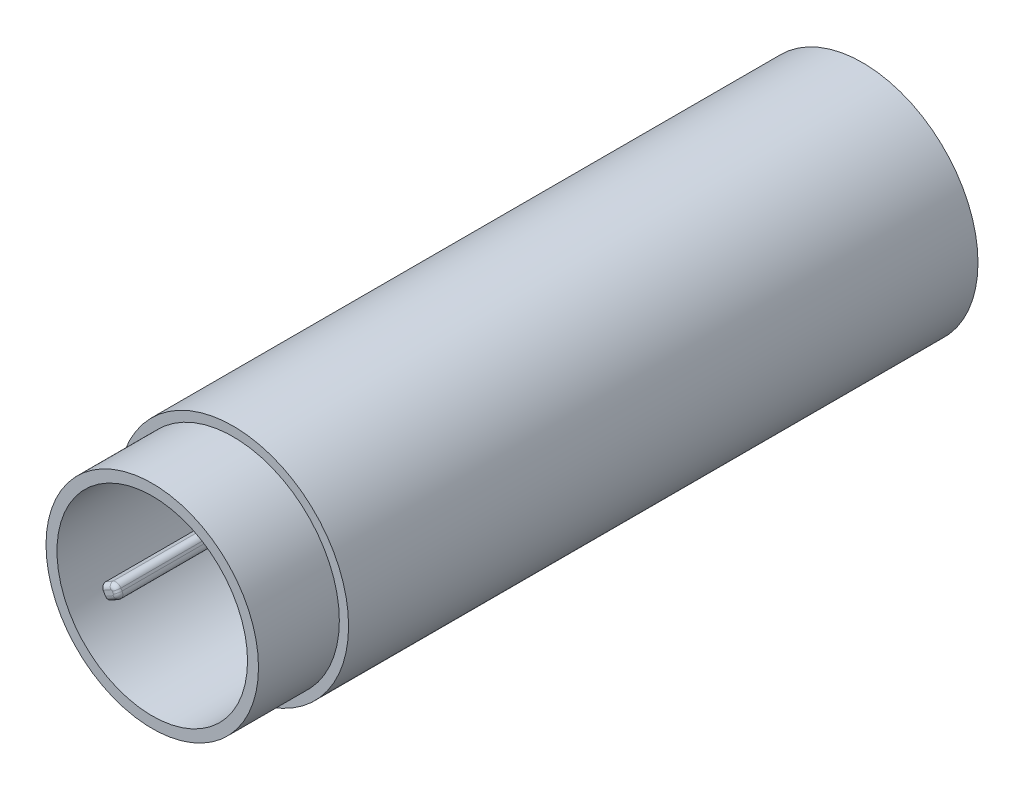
from build123d import *
from build123d.topology import SkipClean

# Parameters (mm, degrees)
ESQUISSE1_R                        = 10
ESQUISSE1_R_2                      = 8.25
BASE_EXTRUSION_DEPTH               = 61.5
ENL_V_START                        = -7
ESQUISSE2_R                        = 10
ESQUISSE2_R_2                      = 9.2
ENL_V_MAT_EXTRU_1_DEPTH            = 7
BOSS_EXTRU_1_START                 = -50
BOSS_EXTRU_1_DEPTH                 = 50
CONG_1_R                           = 0.5
CONG_3_R                           = 0.4
R_P_TITION_CIRCULAIRE1_COUNT       = 3
CONG_1_OF_R_P_TITION_CIRCULAIRE1_R = 0.5
CONG_3_OF_R_P_TITION_CIRCULAIRE1_R = 0.4
ESQUISSE4_W                        = 1.2
ESQUISSE4_H                        = 1.25
CONG_4_R                           = 0.5
ENL_V_START_2                      = -1.2
ENL_V_MAT_EXTRU_2_DEPTH            = 1.2
R_P_TITION_CIRCULAIRE2_COUNT       = 3


with BuildPart() as part:
    # Esquisse1 → Base-Extrusion (new body)
    with BuildSketch(Plane.XY):
        Circle(ESQUISSE1_R)
        Circle(ESQUISSE1_R_2, mode=Mode.SUBTRACT)
    extrude(amount=BASE_EXTRUSION_DEPTH)

    # Esquisse2 → Enl_v. mat.-Extru.1 (cut)
    with BuildSketch(Plane.XY.offset(61.5).offset(ENL_V_START)):
        Circle(ESQUISSE2_R)
        Circle(ESQUISSE2_R_2, mode=Mode.SUBTRACT)
    extrude(amount=ENL_V_MAT_EXTRU_1_DEPTH, mode=Mode.SUBTRACT)

    # Esquisse3 → Boss.-Extru.1 (add)
    with BuildSketch(Plane.XY.offset(58.5).offset(BOSS_EXTRU_1_START)):
        with BuildLine():
            Line((-0.6, 8.228152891), (-0.6, 7))
            Line((-0.6, 7), (0.6, 7))
            Line((0.6, 7), (0.6, 8.228152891))
            ThreePointArc((0.6, 8.228152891), (0, 8.25), (-0.6, 8.228152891))
        make_face()
    boss_extru_1 = extrude(amount=BOSS_EXTRU_1_DEPTH)

    # Cong_1
    cong_1_edges = [part.edges().sort_by_distance(p)[0] for p in [
        (0.6, 7, 33.5),
        (-0.6, 7, 33.5),
    ]]
    fillet(cong_1_edges, radius=CONG_1_R)

    # Cong_3
    cong_3_edges = [part.edges().sort_by_distance(p)[0] for p in [
        (-0.6, 7.864076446, 58.5),
        (0.6, 7.864076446, 58.5),
        (0, 7, 58.5),
        (0.453553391, 7.146446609, 58.5),
        (-0.453553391, 7.146446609, 58.5),
    ]]
    fillet(cong_3_edges, radius=CONG_3_R)

    # R_p_tition circulaire1: Boss.-Extru.1 ×3 about axis
    r_p_tition_circulaire1_axis = Axis((0, 0, 0), (0, 0, 1))
    for i in range(1, R_P_TITION_CIRCULAIRE1_COUNT):
        add(boss_extru_1.rotate(r_p_tition_circulaire1_axis, i * 360 / R_P_TITION_CIRCULAIRE1_COUNT))

    # Cong_1 of R_p_tition circulaire1
    cong_1_of_r_p_tition_circulaire1_edges = [part.edges().sort_by_distance(p)[0] for p in [
        (-6.362177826, -2.980384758, 33.5),
        (-5.762177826, -4.019615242, 33.5),
        (5.762177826, -4.019615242, 33.5),
        (6.362177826, -2.980384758, 33.5),
    ]]
    fillet(cong_1_of_r_p_tition_circulaire1_edges, radius=CONG_1_OF_R_P_TITION_CIRCULAIRE1_R)

    # Cong_3 of R_p_tition circulaire1
    cong_3_of_r_p_tition_circulaire1_edges = [part.edges().sort_by_distance(p)[0] for p in [
        (-6.510489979, -4.451653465, 58.5),
        (-7.110489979, -3.412422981, 58.5),
        (-6.062177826, -3.5, 58.5),
        (-6.415781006, -3.180434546, 58.5),
        (-5.962227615, -3.966012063, 58.5),
        (7.110489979, -3.412422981, 58.5),
        (6.510489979, -4.451653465, 58.5),
        (6.062177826, -3.5, 58.5),
        (5.962227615, -3.966012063, 58.5),
        (6.415781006, -3.180434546, 58.5),
    ]]
    fillet(cong_3_of_r_p_tition_circulaire1_edges, radius=CONG_3_OF_R_P_TITION_CIRCULAIRE1_R)

    # Esquisse4 → Boss.-R_vol.1 (revolve)
    with BuildSketch(Plane(origin=(0, 0, 0), x_dir=(0, 0, -1), z_dir=(1, 0, 0)), mode=Mode.PRIVATE) as boss_r_vol_1_sk:
        with Locations((-7.4, 7.625)):
            Rectangle(ESQUISSE4_W, ESQUISSE4_H)
    revolve(boss_r_vol_1_sk.sketch.rotate(Axis((0, 0, 13.30564115), (0, 0, -1)), 90), axis=Axis((0, 0, 13.30564115), (0, 0, -1)))

    # Cong_4
    cong_4_edges = [part.edges().sort_by_distance(p)[0] for p in [
        (-7, 0, 8),
        (-7, 0, 6.8),
    ]]
    fillet(cong_4_edges, radius=CONG_4_R)

    # Esquisse5 → Enl_v. mat.-Extru.2 (cut)
    with BuildSketch(Plane(origin=(0, 0, 6.8), x_dir=(-1, 0, 0), z_dir=(0, 0, -1)).offset(ENL_V_START_2)):
        with BuildLine():
            Line((-1, 8.189169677), (-1, 6.92820323))
            ThreePointArc((-1, 6.92820323), (0, 7), (1, 6.92820323))
            Line((1, 6.92820323), (1, 8.189169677))
            ThreePointArc((1, 8.189169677), (0, 8.25), (-1, 8.189169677))
        make_face()
    enl_v_mat_extru_2 = extrude(amount=ENL_V_MAT_EXTRU_2_DEPTH, mode=Mode.SUBTRACT)

    # R_p_tition circulaire2: Enl_v. mat.-Extru.2 ×3 about axis
    with SkipClean():  # the faces are left unmerged after this step: merging them gives an invalid solid
        r_p_tition_circulaire2_axis = Axis((0, 0, 0), (0, 0, 1))
        for i in range(1, R_P_TITION_CIRCULAIRE2_COUNT):
            add(enl_v_mat_extru_2.rotate(r_p_tition_circulaire2_axis, i * 360 / R_P_TITION_CIRCULAIRE2_COUNT), mode=Mode.SUBTRACT)


solid = part.part
